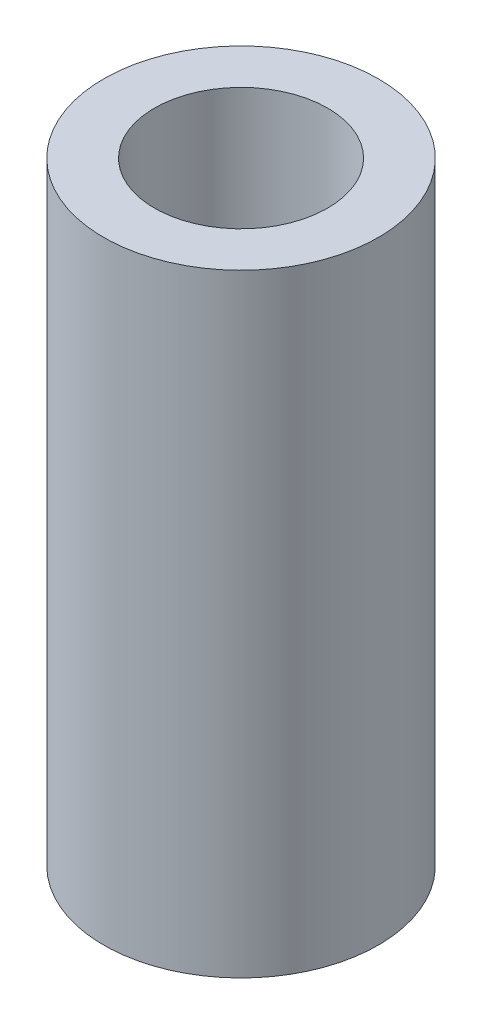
from build123d import *

# Parameters (mm, degrees)
ESQUISSE1_R      = 6.5
ESQUISSE1_R_2    = 4.1
EXTRUSION1_DEPTH = 29


with BuildPart() as part:
    # Esquisse1 → Extrusion1 (new body)
    with BuildSketch(Plane(origin=(0, 0, 0), x_dir=(1, 0, 0), z_dir=(0, 1, 0))):
        with Locations(Location((0, 0, 0), (0, 0, 90))):
            Circle(ESQUISSE1_R)
        with Locations(Location((0, 0, 0), (0, 0, 90))):
            Circle(ESQUISSE1_R_2, mode=Mode.SUBTRACT)
    extrude(amount=EXTRUSION1_DEPTH)


solid = part.part
